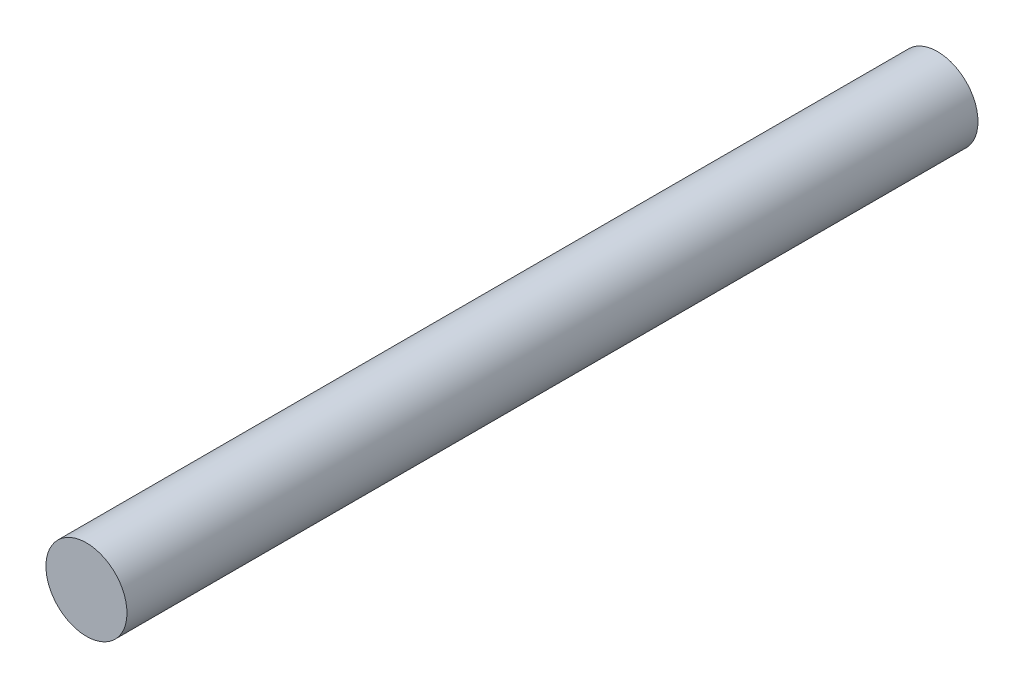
ISO-10303-21;
HEADER;
FILE_DESCRIPTION(('STEP AP214'),'2;1');
FILE_NAME('part.step','',(''),(''),'','','');
FILE_SCHEMA(('AUTOMOTIVE_DESIGN { 1 0 10303 214 1 1 1 1 }'));
ENDSEC;
DATA;
#1=APPLICATION_CONTEXT('core data for automotive mechanical design processes');
#2=APPLICATION_PROTOCOL_DEFINITION('international standard','automotive_design',2000,#1);
#3=PRODUCT_CONTEXT('',#1,'mechanical');
#4=PRODUCT('Part','Part','',(#3));
#5=PRODUCT_RELATED_PRODUCT_CATEGORY('part','',(#4));
#6=PRODUCT_DEFINITION_FORMATION('','',#4);
#7=PRODUCT_DEFINITION_CONTEXT('part definition',#1,'design');
#8=PRODUCT_DEFINITION('design','',#6,#7);
#9=PRODUCT_DEFINITION_SHAPE('','',#8);
#10=(LENGTH_UNIT() NAMED_UNIT(*) SI_UNIT(.MILLI.,.METRE.));
#11=(NAMED_UNIT(*) PLANE_ANGLE_UNIT() SI_UNIT($,.RADIAN.));
#12=(NAMED_UNIT(*) SI_UNIT($,.STERADIAN.) SOLID_ANGLE_UNIT());
#13=UNCERTAINTY_MEASURE_WITH_UNIT(LENGTH_MEASURE(1.E-05),#10,'distance_accuracy_value','');
#14=(GEOMETRIC_REPRESENTATION_CONTEXT(3) GLOBAL_UNCERTAINTY_ASSIGNED_CONTEXT((#13)) GLOBAL_UNIT_ASSIGNED_CONTEXT((#10,
#11,#12)) REPRESENTATION_CONTEXT('',''));
#15=CARTESIAN_POINT('',(0.,0.,0.));
#16=DIRECTION('',(0.,0.,1.));
#17=DIRECTION('',(1.,0.,0.));
#18=AXIS2_PLACEMENT_3D('',#15,#16,#17);
#19=CARTESIAN_POINT('',(-1.11022302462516E-13,-6.66133814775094E-13,-20.));
#20=DIRECTION('',(0.,0.,1.));
#21=DIRECTION('',(1.,0.,0.));
#22=AXIS2_PLACEMENT_3D('',#19,#20,#21);
#23=CYLINDRICAL_SURFACE('',#22,5.);
#24=CARTESIAN_POINT('',(-1.11022302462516E-13,-6.66133814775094E-13,-20.));
#25=DIRECTION('',(0.,0.,1.));
#26=DIRECTION('',(1.,0.,0.));
#27=AXIS2_PLACEMENT_3D('',#24,#25,#26);
#28=CIRCLE('',#27,5.);
#29=CARTESIAN_POINT('',(4.99999999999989,-6.64746035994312E-13,-20.));
#30=VERTEX_POINT('',#29);
#31=EDGE_CURVE('E11',#30,#30,#28,.T.);
#32=ORIENTED_EDGE('',*,*,#31,.T.);
#33=EDGE_LOOP('',(#32));
#34=FACE_BOUND('',#33,.T.);
#35=CARTESIAN_POINT('',(0.,0.,85.));
#36=DIRECTION('',(0.,0.,1.));
#37=DIRECTION('',(1.,0.,0.));
#38=AXIS2_PLACEMENT_3D('',#35,#36,#37);
#39=CIRCLE('',#38,5.);
#40=CARTESIAN_POINT('',(5.,0.,85.));
#41=VERTEX_POINT('',#40);
#42=EDGE_CURVE('E46',#41,#41,#39,.T.);
#43=ORIENTED_EDGE('',*,*,#42,.F.);
#44=EDGE_LOOP('',(#43));
#45=FACE_BOUND('',#44,.T.);
#46=ADVANCED_FACE('F40',(#34,#45),#23,.T.);
#47=CARTESIAN_POINT('',(-1.11022302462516E-13,-6.66133814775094E-13,-20.));
#48=DIRECTION('',(0.,0.,1.));
#49=DIRECTION('',(1.,0.,0.));
#50=AXIS2_PLACEMENT_3D('',#47,#48,#49);
#51=PLANE('',#50);
#52=CARTESIAN_POINT('',(-1.11022302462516E-13,-6.66133814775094E-13,-20.));
#53=DIRECTION('',(0.,0.,-1.));
#54=DIRECTION('',(-1.,0.,0.));
#55=AXIS2_PLACEMENT_3D('',#52,#53,#54);
#56=CIRCLE('',#55,2.5);
#57=CARTESIAN_POINT('',(-2.50000000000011,-6.66827704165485E-13,-20.));
#58=VERTEX_POINT('',#57);
#59=EDGE_CURVE('E59',#58,#58,#56,.T.);
#60=ORIENTED_EDGE('',*,*,#59,.F.);
#61=EDGE_LOOP('',(#60));
#62=FACE_BOUND('',#61,.T.);
#63=ORIENTED_EDGE('',*,*,#31,.F.);
#64=EDGE_LOOP('',(#63));
#65=FACE_BOUND('',#64,.T.);
#66=ADVANCED_FACE('F67',(#62,#65),#51,.F.);
#67=CARTESIAN_POINT('',(0.,0.,85.));
#68=DIRECTION('',(0.,0.,1.));
#69=DIRECTION('',(1.,0.,0.));
#70=AXIS2_PLACEMENT_3D('',#67,#68,#69);
#71=PLANE('',#70);
#72=ORIENTED_EDGE('',*,*,#42,.T.);
#73=EDGE_LOOP('',(#72));
#74=FACE_BOUND('',#73,.T.);
#75=ADVANCED_FACE('F53',(#74),#71,.T.);
#76=CARTESIAN_POINT('',(0.,0.,-4.50215154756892));
#77=DIRECTION('',(0.,0.,-1.));
#78=DIRECTION('',(-1.,0.,0.));
#79=AXIS2_PLACEMENT_3D('',#76,#77,#78);
#80=CONICAL_SURFACE('',#79,2.5,1.02974425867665);
#81=CARTESIAN_POINT('',(0.,-2.22044604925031E-13,-3.));
#82=VERTEX_POINT('',#81);
#83=VERTEX_LOOP('',#82);
#84=FACE_BOUND('',#83,.T.);
#85=CARTESIAN_POINT('',(0.,0.,-4.50215154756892));
#86=DIRECTION('',(0.,0.,-1.));
#87=DIRECTION('',(-1.,0.,0.));
#88=AXIS2_PLACEMENT_3D('',#85,#86,#87);
#89=CIRCLE('',#88,2.5);
#90=CARTESIAN_POINT('',(-2.5,0.,-4.50215154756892));
#91=VERTEX_POINT('',#90);
#92=EDGE_CURVE('E57',#91,#91,#89,.T.);
#93=ORIENTED_EDGE('',*,*,#92,.T.);
#94=EDGE_LOOP('',(#93));
#95=FACE_BOUND('',#94,.T.);
#96=ADVANCED_FACE('F49',(#84,#95),#80,.F.);
#97=CARTESIAN_POINT('',(-1.11022302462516E-13,-6.66133814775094E-13,-20.));
#98=DIRECTION('',(0.,0.,-1.));
#99=DIRECTION('',(-1.,0.,0.));
#100=AXIS2_PLACEMENT_3D('',#97,#98,#99);
#101=CYLINDRICAL_SURFACE('',#100,2.5);
#102=ORIENTED_EDGE('',*,*,#92,.F.);
#103=EDGE_LOOP('',(#102));
#104=FACE_BOUND('',#103,.T.);
#105=ORIENTED_EDGE('',*,*,#59,.T.);
#106=EDGE_LOOP('',(#105));
#107=FACE_BOUND('',#106,.T.);
#108=ADVANCED_FACE('F52',(#104,#107),#101,.F.);
#109=CLOSED_SHELL('',(#46,#66,#75,#96,#108));
#110=MANIFOLD_SOLID_BREP('B2',#109);
#111=ADVANCED_BREP_SHAPE_REPRESENTATION('',(#18,#110),#14);
#112=SHAPE_DEFINITION_REPRESENTATION(#9,#111);
ENDSEC;
END-ISO-10303-21;
